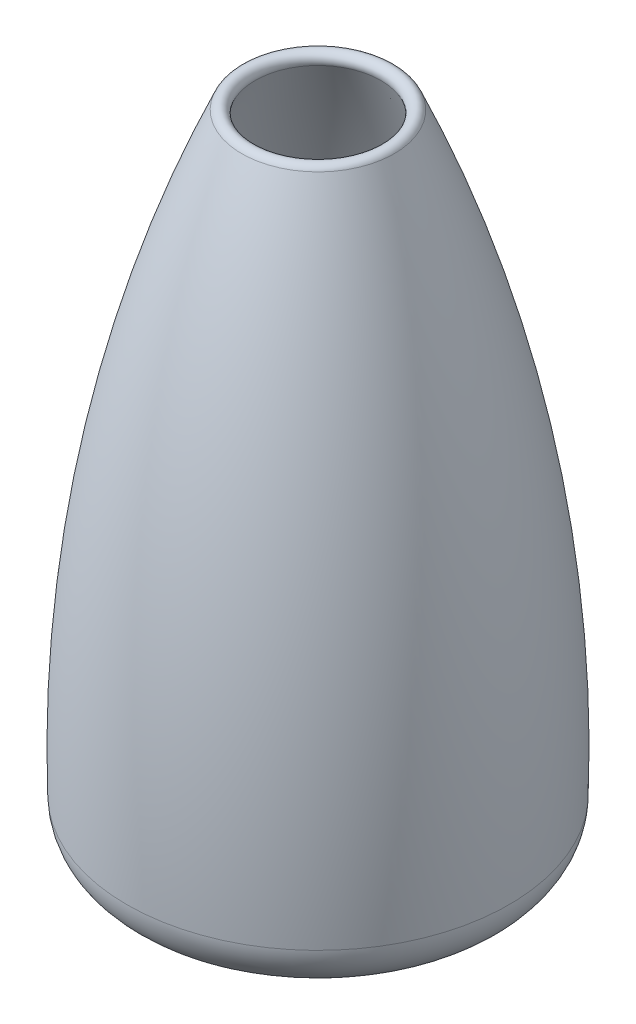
ISO-10303-21;
HEADER;
FILE_DESCRIPTION(('STEP AP214'),'2;1');
FILE_NAME('part.step','',(''),(''),'','','');
FILE_SCHEMA(('AUTOMOTIVE_DESIGN { 1 0 10303 214 1 1 1 1 }'));
ENDSEC;
DATA;
#1=APPLICATION_CONTEXT('core data for automotive mechanical design processes');
#2=APPLICATION_PROTOCOL_DEFINITION('international standard','automotive_design',2000,#1);
#3=PRODUCT_CONTEXT('',#1,'mechanical');
#4=PRODUCT('Part','Part','',(#3));
#5=PRODUCT_RELATED_PRODUCT_CATEGORY('part','',(#4));
#6=PRODUCT_DEFINITION_FORMATION('','',#4);
#7=PRODUCT_DEFINITION_CONTEXT('part definition',#1,'design');
#8=PRODUCT_DEFINITION('design','',#6,#7);
#9=PRODUCT_DEFINITION_SHAPE('','',#8);
#10=(LENGTH_UNIT() NAMED_UNIT(*) SI_UNIT(.MILLI.,.METRE.));
#11=(NAMED_UNIT(*) PLANE_ANGLE_UNIT() SI_UNIT($,.RADIAN.));
#12=(NAMED_UNIT(*) SI_UNIT($,.STERADIAN.) SOLID_ANGLE_UNIT());
#13=UNCERTAINTY_MEASURE_WITH_UNIT(LENGTH_MEASURE(1.E-05),#10,'distance_accuracy_value','');
#14=(GEOMETRIC_REPRESENTATION_CONTEXT(3) GLOBAL_UNCERTAINTY_ASSIGNED_CONTEXT((#13)) GLOBAL_UNIT_ASSIGNED_CONTEXT((#10,
#11,#12)) REPRESENTATION_CONTEXT('',''));
#15=CARTESIAN_POINT('',(0.,0.,0.));
#16=DIRECTION('',(0.,0.,1.));
#17=DIRECTION('',(1.,0.,0.));
#18=AXIS2_PLACEMENT_3D('',#15,#16,#17);
#19=CARTESIAN_POINT('',(0.,0.,0.));
#20=DIRECTION('',(0.,-1.,0.));
#21=DIRECTION('',(0.,0.,-1.));
#22=AXIS2_PLACEMENT_3D('',#19,#20,#21);
#23=PLANE('',#22);
#24=CARTESIAN_POINT('',(0.,0.,0.));
#25=DIRECTION('',(0.,-1.,0.));
#26=DIRECTION('',(0.,0.,-1.));
#27=AXIS2_PLACEMENT_3D('',#24,#25,#26);
#28=CIRCLE('',#27,28.9808098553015);
#29=CARTESIAN_POINT('',(0.,0.,-28.9808098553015));
#30=VERTEX_POINT('',#29);
#31=EDGE_CURVE('E10',#30,#30,#28,.T.);
#32=ORIENTED_EDGE('',*,*,#31,.T.);
#33=EDGE_LOOP('',(#32));
#34=FACE_BOUND('',#33,.T.);
#35=ADVANCED_FACE('F31',(#34),#23,.T.);
#36=CARTESIAN_POINT('',(0.,10.,0.));
#37=DIRECTION('',(0.,-1.,0.));
#38=DIRECTION('',(0.,0.,-1.));
#39=AXIS2_PLACEMENT_3D('',#36,#37,#38);
#40=TOROIDAL_SURFACE('',#39,28.9808098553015,9.99999999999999);
#41=CARTESIAN_POINT('',(0.,9.71241737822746,0.));
#42=DIRECTION('',(0.,-1.,0.));
#43=DIRECTION('',(0.,0.,-1.));
#44=AXIS2_PLACEMENT_3D('',#41,#42,#43);
#45=CIRCLE('',#44,38.9766738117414);
#46=CARTESIAN_POINT('',(0.,9.71241737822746,-38.9766738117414));
#47=VERTEX_POINT('',#46);
#48=EDGE_CURVE('E37',#47,#47,#45,.T.);
#49=ORIENTED_EDGE('',*,*,#48,.T.);
#50=EDGE_LOOP('',(#49));
#51=FACE_BOUND('',#50,.T.);
#52=ORIENTED_EDGE('',*,*,#31,.F.);
#53=EDGE_LOOP('',(#52));
#54=FACE_BOUND('',#53,.T.);
#55=ADVANCED_FACE('F69',(#51,#54),#40,.T.);
#56=CARTESIAN_POINT('',(0.,17.8256167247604,0.));
#57=DIRECTION('',(0.,-1.,0.));
#58=DIRECTION('',(0.,0.,-1.));
#59=AXIS2_PLACEMENT_3D('',#56,#57,#58);
#60=DEGENERATE_TOROIDAL_SURFACE('',#59,243.023804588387,282.117163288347,.F.);
#61=CARTESIAN_POINT('',(0.,130.64464735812,0.));
#62=DIRECTION('',(0.,-1.,0.));
#63=DIRECTION('',(0.,0.,-1.));
#64=AXIS2_PLACEMENT_3D('',#61,#62,#63);
#65=CIRCLE('',#64,15.5529928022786);
#66=CARTESIAN_POINT('',(0.,130.64464735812,-15.5529928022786));
#67=VERTEX_POINT('',#66);
#68=EDGE_CURVE('E41',#67,#67,#65,.T.);
#69=ORIENTED_EDGE('',*,*,#68,.T.);
#70=EDGE_LOOP('',(#69));
#71=FACE_BOUND('',#70,.T.);
#72=ORIENTED_EDGE('',*,*,#48,.F.);
#73=EDGE_LOOP('',(#72));
#74=FACE_BOUND('',#73,.T.);
#75=ADVANCED_FACE('F73',(#71,#74),#60,.F.);
#76=CARTESIAN_POINT('',(0.,130.04467961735,0.));
#77=DIRECTION('',(0.,-1.,0.));
#78=DIRECTION('',(0.,0.,-1.));
#79=AXIS2_PLACEMENT_3D('',#76,#77,#78);
#80=TOROIDAL_SURFACE('',#79,14.1778902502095,1.50028941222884);
#81=CARTESIAN_POINT('',(0.,129.391168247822,0.));
#82=DIRECTION('',(0.,-1.,0.));
#83=DIRECTION('',(0.,0.,-1.));
#84=AXIS2_PLACEMENT_3D('',#81,#82,#83);
#85=CIRCLE('',#84,12.8274121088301);
#86=CARTESIAN_POINT('',(0.,129.391168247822,-12.8274121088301));
#87=VERTEX_POINT('',#86);
#88=EDGE_CURVE('E45',#87,#87,#85,.T.);
#89=ORIENTED_EDGE('',*,*,#88,.T.);
#90=EDGE_LOOP('',(#89));
#91=FACE_BOUND('',#90,.T.);
#92=ORIENTED_EDGE('',*,*,#68,.F.);
#93=EDGE_LOOP('',(#92));
#94=FACE_BOUND('',#93,.T.);
#95=ADVANCED_FACE('F77',(#91,#94),#80,.T.);
#96=CARTESIAN_POINT('',(0.,46.937174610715,0.));
#97=DIRECTION('',(0.,-1.,0.));
#98=DIRECTION('',(0.,0.,-1.));
#99=AXIS2_PLACEMENT_3D('',#96,#97,#98);
#100=DEGENERATE_TOROIDAL_SURFACE('',#99,157.564710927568,189.293783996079,.F.);
#101=CARTESIAN_POINT('',(0.,35.1405821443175,0.));
#102=DIRECTION('',(0.,-1.,0.));
#103=DIRECTION('',(0.,0.,-1.));
#104=AXIS2_PLACEMENT_3D('',#101,#102,#103);
#105=CIRCLE('',#104,31.361139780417);
#106=CARTESIAN_POINT('',(0.,35.1405821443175,-31.361139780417));
#107=VERTEX_POINT('',#106);
#108=EDGE_CURVE('E50',#107,#107,#105,.T.);
#109=ORIENTED_EDGE('',*,*,#108,.T.);
#110=EDGE_LOOP('',(#109));
#111=FACE_BOUND('',#110,.T.);
#112=ORIENTED_EDGE('',*,*,#88,.F.);
#113=EDGE_LOOP('',(#112));
#114=FACE_BOUND('',#113,.T.);
#115=ADVANCED_FACE('F66',(#111,#114),#100,.T.);
#116=CARTESIAN_POINT('',(0.,36.3869614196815,0.));
#117=DIRECTION('',(0.,-1.,0.));
#118=DIRECTION('',(0.,0.,-1.));
#119=AXIS2_PLACEMENT_3D('',#116,#117,#118);
#120=DEGENERATE_TOROIDAL_SURFACE('',#119,11.4000140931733,20.,.T.);
#121=CARTESIAN_POINT('',(0.,16.3869614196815,0.));
#122=DIRECTION('',(0.,-1.,0.));
#123=DIRECTION('',(0.,0.,-1.));
#124=AXIS2_PLACEMENT_3D('',#121,#122,#123);
#125=CIRCLE('',#124,11.4000140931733);
#126=CARTESIAN_POINT('',(0.,16.3869614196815,-11.4000140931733));
#127=VERTEX_POINT('',#126);
#128=EDGE_CURVE('E53',#127,#127,#125,.T.);
#129=ORIENTED_EDGE('',*,*,#128,.T.);
#130=EDGE_LOOP('',(#129));
#131=FACE_BOUND('',#130,.T.);
#132=ORIENTED_EDGE('',*,*,#108,.F.);
#133=EDGE_LOOP('',(#132));
#134=FACE_BOUND('',#133,.T.);
#135=ADVANCED_FACE('F57',(#131,#134),#120,.F.);
#136=CARTESIAN_POINT('',(0.,16.3869614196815,0.));
#137=DIRECTION('',(0.,1.,0.));
#138=DIRECTION('',(0.,0.,1.));
#139=AXIS2_PLACEMENT_3D('',#136,#137,#138);
#140=PLANE('',#139);
#141=ORIENTED_EDGE('',*,*,#128,.F.);
#142=EDGE_LOOP('',(#141));
#143=FACE_BOUND('',#142,.T.);
#144=ADVANCED_FACE('F60',(#143),#140,.T.);
#145=CLOSED_SHELL('',(#35,#55,#75,#95,#115,#135,#144));
#146=MANIFOLD_SOLID_BREP('B2',#145);
#147=ADVANCED_BREP_SHAPE_REPRESENTATION('',(#18,#146),#14);
#148=SHAPE_DEFINITION_REPRESENTATION(#9,#147);
ENDSEC;
END-ISO-10303-21;
